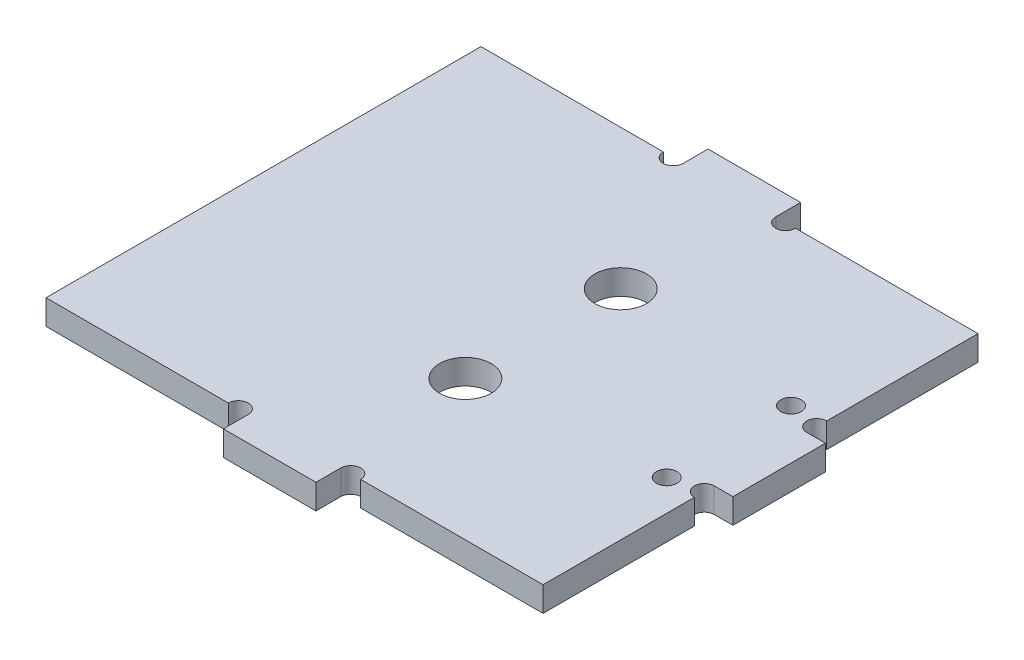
ISO-10303-21;
HEADER;
FILE_DESCRIPTION(('STEP AP214'),'2;1');
FILE_NAME('part.step','',(''),(''),'','','');
FILE_SCHEMA(('AUTOMOTIVE_DESIGN { 1 0 10303 214 1 1 1 1 }'));
ENDSEC;
DATA;
#1=APPLICATION_CONTEXT('core data for automotive mechanical design processes');
#2=APPLICATION_PROTOCOL_DEFINITION('international standard','automotive_design',2000,#1);
#3=PRODUCT_CONTEXT('',#1,'mechanical');
#4=PRODUCT('Part','Part','',(#3));
#5=PRODUCT_RELATED_PRODUCT_CATEGORY('part','',(#4));
#6=PRODUCT_DEFINITION_FORMATION('','',#4);
#7=PRODUCT_DEFINITION_CONTEXT('part definition',#1,'design');
#8=PRODUCT_DEFINITION('design','',#6,#7);
#9=PRODUCT_DEFINITION_SHAPE('','',#8);
#10=(LENGTH_UNIT() NAMED_UNIT(*) SI_UNIT(.MILLI.,.METRE.));
#11=(NAMED_UNIT(*) PLANE_ANGLE_UNIT() SI_UNIT($,.RADIAN.));
#12=(NAMED_UNIT(*) SI_UNIT($,.STERADIAN.) SOLID_ANGLE_UNIT());
#13=UNCERTAINTY_MEASURE_WITH_UNIT(LENGTH_MEASURE(1.E-05),#10,'distance_accuracy_value','');
#14=(GEOMETRIC_REPRESENTATION_CONTEXT(3) GLOBAL_UNCERTAINTY_ASSIGNED_CONTEXT((#13)) GLOBAL_UNIT_ASSIGNED_CONTEXT((#10,
#11,#12)) REPRESENTATION_CONTEXT('',''));
#15=CARTESIAN_POINT('',(0.,0.,0.));
#16=DIRECTION('',(0.,0.,1.));
#17=DIRECTION('',(1.,0.,0.));
#18=AXIS2_PLACEMENT_3D('',#15,#16,#17);
#19=CARTESIAN_POINT('',(30.95,-6.,0.));
#20=DIRECTION('',(0.,1.,0.));
#21=DIRECTION('',(0.,0.,1.));
#22=AXIS2_PLACEMENT_3D('',#19,#20,#21);
#23=CYLINDRICAL_SURFACE('',#22,1.6);
#24=CARTESIAN_POINT('',(30.95,0.,0.));
#25=DIRECTION('',(0.,1.,0.));
#26=DIRECTION('',(0.,0.,1.));
#27=AXIS2_PLACEMENT_3D('',#24,#25,#26);
#28=CIRCLE('',#27,1.6);
#29=CARTESIAN_POINT('',(32.55,0.,0.));
#30=VERTEX_POINT('',#29);
#31=CARTESIAN_POINT('',(29.35,0.,0.));
#32=VERTEX_POINT('',#31);
#33=EDGE_CURVE('E456',#30,#32,#28,.T.);
#34=ORIENTED_EDGE('',*,*,#33,.F.);
#35=DIRECTION('',(0.,-1.,0.));
#36=VECTOR('',#35,1.);
#37=CARTESIAN_POINT('',(32.55,4.,0.));
#38=LINE('',#37,#36);
#39=CARTESIAN_POINT('',(32.55,4.,0.));
#40=VERTEX_POINT('',#39);
#41=EDGE_CURVE('E224',#40,#30,#38,.T.);
#42=ORIENTED_EDGE('',*,*,#41,.F.);
#43=CARTESIAN_POINT('',(30.95,4.,0.));
#44=DIRECTION('',(0.,1.,0.));
#45=DIRECTION('',(0.,0.,1.));
#46=AXIS2_PLACEMENT_3D('',#43,#44,#45);
#47=CIRCLE('',#46,1.6);
#48=CARTESIAN_POINT('',(29.35,4.,0.));
#49=VERTEX_POINT('',#48);
#50=EDGE_CURVE('E117',#40,#49,#47,.T.);
#51=ORIENTED_EDGE('',*,*,#50,.T.);
#52=DIRECTION('',(0.,1.,0.));
#53=VECTOR('',#52,1.);
#54=CARTESIAN_POINT('',(29.35,-6.,0.));
#55=LINE('',#54,#53);
#56=EDGE_CURVE('E246',#32,#49,#55,.T.);
#57=ORIENTED_EDGE('',*,*,#56,.F.);
#58=EDGE_LOOP('',(#34,#42,#51,#57));
#59=FACE_BOUND('',#58,.T.);
#60=ADVANCED_FACE('F17',(#59),#23,.F.);
#61=CARTESIAN_POINT('',(49.05,-6.,0.));
#62=DIRECTION('',(0.,1.,0.));
#63=DIRECTION('',(0.,0.,1.));
#64=AXIS2_PLACEMENT_3D('',#61,#62,#63);
#65=CYLINDRICAL_SURFACE('',#64,1.6);
#66=CARTESIAN_POINT('',(49.05,0.,0.));
#67=DIRECTION('',(0.,1.,0.));
#68=DIRECTION('',(0.,0.,1.));
#69=AXIS2_PLACEMENT_3D('',#66,#67,#68);
#70=CIRCLE('',#69,1.6);
#71=CARTESIAN_POINT('',(50.65,0.,0.));
#72=VERTEX_POINT('',#71);
#73=CARTESIAN_POINT('',(47.45,0.,0.));
#74=VERTEX_POINT('',#73);
#75=EDGE_CURVE('E125',#72,#74,#70,.T.);
#76=ORIENTED_EDGE('',*,*,#75,.F.);
#77=DIRECTION('',(0.,-1.,0.));
#78=VECTOR('',#77,1.);
#79=CARTESIAN_POINT('',(50.65,-6.,0.));
#80=LINE('',#79,#78);
#81=CARTESIAN_POINT('',(50.65,4.,0.));
#82=VERTEX_POINT('',#81);
#83=EDGE_CURVE('E121',#82,#72,#80,.T.);
#84=ORIENTED_EDGE('',*,*,#83,.F.);
#85=CARTESIAN_POINT('',(49.05,4.,0.));
#86=DIRECTION('',(0.,1.,0.));
#87=DIRECTION('',(0.,0.,1.));
#88=AXIS2_PLACEMENT_3D('',#85,#86,#87);
#89=CIRCLE('',#88,1.6);
#90=CARTESIAN_POINT('',(47.45,4.,0.));
#91=VERTEX_POINT('',#90);
#92=EDGE_CURVE('E105',#82,#91,#89,.T.);
#93=ORIENTED_EDGE('',*,*,#92,.T.);
#94=DIRECTION('',(0.,-1.,0.));
#95=VECTOR('',#94,1.);
#96=CARTESIAN_POINT('',(47.45,4.,0.));
#97=LINE('',#96,#95);
#98=EDGE_CURVE('E141',#91,#74,#97,.T.);
#99=ORIENTED_EDGE('',*,*,#98,.T.);
#100=EDGE_LOOP('',(#76,#84,#93,#99));
#101=FACE_BOUND('',#100,.T.);
#102=ADVANCED_FACE('F122',(#101),#65,.F.);
#103=CARTESIAN_POINT('',(80.,-6.,-25.95));
#104=DIRECTION('',(0.,1.,0.));
#105=DIRECTION('',(0.,0.,1.));
#106=AXIS2_PLACEMENT_3D('',#103,#104,#105);
#107=CYLINDRICAL_SURFACE('',#106,1.6);
#108=CARTESIAN_POINT('',(80.,0.,-25.95));
#109=DIRECTION('',(0.,1.,0.));
#110=DIRECTION('',(0.,0.,1.));
#111=AXIS2_PLACEMENT_3D('',#108,#109,#110);
#112=CIRCLE('',#111,1.6);
#113=CARTESIAN_POINT('',(80.,0.,-27.55));
#114=VERTEX_POINT('',#113);
#115=CARTESIAN_POINT('',(80.,0.,-24.35));
#116=VERTEX_POINT('',#115);
#117=EDGE_CURVE('E518',#114,#116,#112,.T.);
#118=ORIENTED_EDGE('',*,*,#117,.F.);
#119=DIRECTION('',(0.,-1.,0.));
#120=VECTOR('',#119,1.);
#121=CARTESIAN_POINT('',(80.,4.,-27.55));
#122=LINE('',#121,#120);
#123=CARTESIAN_POINT('',(80.,4.,-27.55));
#124=VERTEX_POINT('',#123);
#125=EDGE_CURVE('E374',#124,#114,#122,.T.);
#126=ORIENTED_EDGE('',*,*,#125,.F.);
#127=CARTESIAN_POINT('',(80.,4.,-25.95));
#128=DIRECTION('',(0.,1.,0.));
#129=DIRECTION('',(0.,0.,1.));
#130=AXIS2_PLACEMENT_3D('',#127,#128,#129);
#131=CIRCLE('',#130,1.6);
#132=CARTESIAN_POINT('',(80.,4.,-24.35));
#133=VERTEX_POINT('',#132);
#134=EDGE_CURVE('E26',#124,#133,#131,.T.);
#135=ORIENTED_EDGE('',*,*,#134,.T.);
#136=DIRECTION('',(0.,1.,0.));
#137=VECTOR('',#136,1.);
#138=CARTESIAN_POINT('',(80.,-6.,-24.35));
#139=LINE('',#138,#137);
#140=EDGE_CURVE('E169',#116,#133,#139,.T.);
#141=ORIENTED_EDGE('',*,*,#140,.F.);
#142=EDGE_LOOP('',(#118,#126,#135,#141));
#143=FACE_BOUND('',#142,.T.);
#144=ADVANCED_FACE('F949',(#143),#107,.F.);
#145=CARTESIAN_POINT('',(80.,-6.,-44.05));
#146=DIRECTION('',(0.,1.,0.));
#147=DIRECTION('',(0.,0.,1.));
#148=AXIS2_PLACEMENT_3D('',#145,#146,#147);
#149=CYLINDRICAL_SURFACE('',#148,1.6);
#150=CARTESIAN_POINT('',(80.,4.,-44.05));
#151=DIRECTION('',(0.,1.,0.));
#152=DIRECTION('',(0.,0.,1.));
#153=AXIS2_PLACEMENT_3D('',#150,#151,#152);
#154=CIRCLE('',#153,1.6);
#155=CARTESIAN_POINT('',(80.,4.,-45.65));
#156=VERTEX_POINT('',#155);
#157=CARTESIAN_POINT('',(80.,4.,-42.45));
#158=VERTEX_POINT('',#157);
#159=EDGE_CURVE('E11',#156,#158,#154,.T.);
#160=ORIENTED_EDGE('',*,*,#159,.T.);
#161=DIRECTION('',(0.,-1.,0.));
#162=VECTOR('',#161,1.);
#163=CARTESIAN_POINT('',(80.,4.,-42.45));
#164=LINE('',#163,#162);
#165=CARTESIAN_POINT('',(80.,0.,-42.45));
#166=VERTEX_POINT('',#165);
#167=EDGE_CURVE('E366',#158,#166,#164,.T.);
#168=ORIENTED_EDGE('',*,*,#167,.T.);
#169=CARTESIAN_POINT('',(80.,0.,-44.05));
#170=DIRECTION('',(0.,1.,0.));
#171=DIRECTION('',(0.,0.,1.));
#172=AXIS2_PLACEMENT_3D('',#169,#170,#171);
#173=CIRCLE('',#172,1.6);
#174=CARTESIAN_POINT('',(80.,0.,-45.65));
#175=VERTEX_POINT('',#174);
#176=EDGE_CURVE('E551',#175,#166,#173,.T.);
#177=ORIENTED_EDGE('',*,*,#176,.F.);
#178=DIRECTION('',(0.,-1.,0.));
#179=VECTOR('',#178,1.);
#180=CARTESIAN_POINT('',(80.,-6.,-45.65));
#181=LINE('',#180,#179);
#182=EDGE_CURVE('E340',#156,#175,#181,.T.);
#183=ORIENTED_EDGE('',*,*,#182,.F.);
#184=EDGE_LOOP('',(#160,#168,#177,#183));
#185=FACE_BOUND('',#184,.T.);
#186=ADVANCED_FACE('F932',(#185),#149,.F.);
#187=CARTESIAN_POINT('',(0.,4.,0.));
#188=DIRECTION('',(0.,1.,0.));
#189=DIRECTION('',(1.,0.,0.));
#190=AXIS2_PLACEMENT_3D('',#187,#188,#189);
#191=PLANE('',#190);
#192=CARTESIAN_POINT('',(45.,4.,-22.5));
#193=DIRECTION('',(0.,1.,0.));
#194=DIRECTION('',(0.,0.,1.));
#195=AXIS2_PLACEMENT_3D('',#192,#193,#194);
#196=CIRCLE('',#195,4.15);
#197=CARTESIAN_POINT('',(45.,4.,-18.35));
#198=VERTEX_POINT('',#197);
#199=EDGE_CURVE('E635',#198,#198,#196,.T.);
#200=ORIENTED_EDGE('',*,*,#199,.F.);
#201=EDGE_LOOP('',(#200));
#202=FACE_BOUND('',#201,.T.);
#203=CARTESIAN_POINT('',(45.,4.,-47.5));
#204=DIRECTION('',(0.,1.,0.));
#205=DIRECTION('',(0.,0.,1.));
#206=AXIS2_PLACEMENT_3D('',#203,#204,#205);
#207=CIRCLE('',#206,4.15);
#208=CARTESIAN_POINT('',(45.,4.,-43.35));
#209=VERTEX_POINT('',#208);
#210=EDGE_CURVE('E653',#209,#209,#207,.T.);
#211=ORIENTED_EDGE('',*,*,#210,.F.);
#212=EDGE_LOOP('',(#211));
#213=FACE_BOUND('',#212,.T.);
#214=CARTESIAN_POINT('',(75.,4.,-24.9000000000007));
#215=DIRECTION('',(0.,1.,0.));
#216=DIRECTION('',(0.,0.,1.));
#217=AXIS2_PLACEMENT_3D('',#214,#215,#216);
#218=CIRCLE('',#217,1.65);
#219=CARTESIAN_POINT('',(75.,4.,-23.2500000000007));
#220=VERTEX_POINT('',#219);
#221=EDGE_CURVE('E671',#220,#220,#218,.T.);
#222=ORIENTED_EDGE('',*,*,#221,.F.);
#223=EDGE_LOOP('',(#222));
#224=FACE_BOUND('',#223,.T.);
#225=CARTESIAN_POINT('',(75.,4.,-44.9000000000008));
#226=DIRECTION('',(0.,1.,0.));
#227=DIRECTION('',(0.,0.,1.));
#228=AXIS2_PLACEMENT_3D('',#225,#226,#227);
#229=CIRCLE('',#228,1.65);
#230=CARTESIAN_POINT('',(75.,4.,-43.2500000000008));
#231=VERTEX_POINT('',#230);
#232=EDGE_CURVE('E691',#231,#231,#229,.T.);
#233=ORIENTED_EDGE('',*,*,#232,.F.);
#234=EDGE_LOOP('',(#233));
#235=FACE_BOUND('',#234,.T.);
#236=CARTESIAN_POINT('',(49.05,4.,-70.));
#237=DIRECTION('',(0.,1.,0.));
#238=DIRECTION('',(0.,0.,1.));
#239=AXIS2_PLACEMENT_3D('',#236,#237,#238);
#240=CIRCLE('',#239,1.6);
#241=CARTESIAN_POINT('',(47.45,4.,-70.));
#242=VERTEX_POINT('',#241);
#243=CARTESIAN_POINT('',(50.65,4.,-70.));
#244=VERTEX_POINT('',#243);
#245=EDGE_CURVE('E617',#242,#244,#240,.T.);
#246=ORIENTED_EDGE('',*,*,#245,.F.);
#247=DIRECTION('',(0.,0.,-1.));
#248=VECTOR('',#247,1.);
#249=CARTESIAN_POINT('',(47.45,4.,0.));
#250=LINE('',#249,#248);
#251=CARTESIAN_POINT('',(47.45,4.,-74.));
#252=VERTEX_POINT('',#251);
#253=EDGE_CURVE('E313',#242,#252,#250,.T.);
#254=ORIENTED_EDGE('',*,*,#253,.T.);
#255=DIRECTION('',(1.,0.,0.));
#256=VECTOR('',#255,1.);
#257=CARTESIAN_POINT('',(0.,4.,-74.));
#258=LINE('',#257,#256);
#259=CARTESIAN_POINT('',(32.55,4.,-74.));
#260=VERTEX_POINT('',#259);
#261=EDGE_CURVE('E286',#260,#252,#258,.T.);
#262=ORIENTED_EDGE('',*,*,#261,.F.);
#263=DIRECTION('',(0.,0.,-1.));
#264=VECTOR('',#263,1.);
#265=CARTESIAN_POINT('',(32.55,4.,0.));
#266=LINE('',#265,#264);
#267=CARTESIAN_POINT('',(32.55,4.,-70.));
#268=VERTEX_POINT('',#267);
#269=EDGE_CURVE('E278',#268,#260,#266,.T.);
#270=ORIENTED_EDGE('',*,*,#269,.F.);
#271=CARTESIAN_POINT('',(30.95,4.,-70.));
#272=DIRECTION('',(0.,1.,0.));
#273=DIRECTION('',(0.,0.,1.));
#274=AXIS2_PLACEMENT_3D('',#271,#272,#273);
#275=CIRCLE('',#274,1.6);
#276=CARTESIAN_POINT('',(29.35,4.,-70.));
#277=VERTEX_POINT('',#276);
#278=EDGE_CURVE('E588',#277,#268,#275,.T.);
#279=ORIENTED_EDGE('',*,*,#278,.F.);
#280=DIRECTION('',(1.,0.,0.));
#281=VECTOR('',#280,1.);
#282=CARTESIAN_POINT('',(0.,4.,-70.));
#283=LINE('',#282,#281);
#284=CARTESIAN_POINT('',(0.,4.,-70.));
#285=VERTEX_POINT('',#284);
#286=EDGE_CURVE('E267',#285,#277,#283,.T.);
#287=ORIENTED_EDGE('',*,*,#286,.F.);
#288=DIRECTION('',(0.,0.,-1.));
#289=VECTOR('',#288,1.);
#290=CARTESIAN_POINT('',(0.,4.,0.));
#291=LINE('',#290,#289);
#292=CARTESIAN_POINT('',(0.,4.,0.));
#293=VERTEX_POINT('',#292);
#294=EDGE_CURVE('E252',#293,#285,#291,.T.);
#295=ORIENTED_EDGE('',*,*,#294,.F.);
#296=DIRECTION('',(1.,0.,0.));
#297=VECTOR('',#296,1.);
#298=CARTESIAN_POINT('',(0.,4.,0.));
#299=LINE('',#298,#297);
#300=EDGE_CURVE('E236',#293,#49,#299,.T.);
#301=ORIENTED_EDGE('',*,*,#300,.T.);
#302=ORIENTED_EDGE('',*,*,#50,.F.);
#303=DIRECTION('',(0.,0.,1.));
#304=VECTOR('',#303,1.);
#305=CARTESIAN_POINT('',(32.55,4.,0.));
#306=LINE('',#305,#304);
#307=CARTESIAN_POINT('',(32.55,4.,4.));
#308=VERTEX_POINT('',#307);
#309=EDGE_CURVE('E235',#40,#308,#306,.T.);
#310=ORIENTED_EDGE('',*,*,#309,.T.);
#311=DIRECTION('',(1.,0.,0.));
#312=VECTOR('',#311,1.);
#313=CARTESIAN_POINT('',(0.,4.,4.));
#314=LINE('',#313,#312);
#315=CARTESIAN_POINT('',(47.45,4.,4.));
#316=VERTEX_POINT('',#315);
#317=EDGE_CURVE('E208',#308,#316,#314,.T.);
#318=ORIENTED_EDGE('',*,*,#317,.T.);
#319=DIRECTION('',(0.,0.,1.));
#320=VECTOR('',#319,1.);
#321=CARTESIAN_POINT('',(47.45,4.,0.));
#322=LINE('',#321,#320);
#323=EDGE_CURVE('E112',#91,#316,#322,.T.);
#324=ORIENTED_EDGE('',*,*,#323,.F.);
#325=ORIENTED_EDGE('',*,*,#92,.F.);
#326=DIRECTION('',(1.,0.,0.));
#327=VECTOR('',#326,1.);
#328=CARTESIAN_POINT('',(0.,4.,0.));
#329=LINE('',#328,#327);
#330=CARTESIAN_POINT('',(80.,4.,0.));
#331=VERTEX_POINT('',#330);
#332=EDGE_CURVE('E110',#82,#331,#329,.T.);
#333=ORIENTED_EDGE('',*,*,#332,.T.);
#334=DIRECTION('',(0.,0.,-1.));
#335=VECTOR('',#334,1.);
#336=CARTESIAN_POINT('',(80.,4.,0.));
#337=LINE('',#336,#335);
#338=EDGE_CURVE('E146',#331,#133,#337,.T.);
#339=ORIENTED_EDGE('',*,*,#338,.T.);
#340=ORIENTED_EDGE('',*,*,#134,.F.);
#341=DIRECTION('',(1.,0.,0.));
#342=VECTOR('',#341,1.);
#343=CARTESIAN_POINT('',(0.,4.,-27.55));
#344=LINE('',#343,#342);
#345=CARTESIAN_POINT('',(83.,4.,-27.55));
#346=VERTEX_POINT('',#345);
#347=EDGE_CURVE('E382',#124,#346,#344,.T.);
#348=ORIENTED_EDGE('',*,*,#347,.T.);
#349=DIRECTION('',(0.,0.,1.));
#350=VECTOR('',#349,1.);
#351=CARTESIAN_POINT('',(83.,4.,0.));
#352=LINE('',#351,#350);
#353=CARTESIAN_POINT('',(83.,4.,-42.45));
#354=VERTEX_POINT('',#353);
#355=EDGE_CURVE('E399',#354,#346,#352,.T.);
#356=ORIENTED_EDGE('',*,*,#355,.F.);
#357=DIRECTION('',(1.,0.,0.));
#358=VECTOR('',#357,1.);
#359=CARTESIAN_POINT('',(80.,4.,-42.45));
#360=LINE('',#359,#358);
#361=EDGE_CURVE('E360',#158,#354,#360,.T.);
#362=ORIENTED_EDGE('',*,*,#361,.F.);
#363=ORIENTED_EDGE('',*,*,#159,.F.);
#364=DIRECTION('',(0.,0.,-1.));
#365=VECTOR('',#364,1.);
#366=CARTESIAN_POINT('',(80.,4.,0.));
#367=LINE('',#366,#365);
#368=CARTESIAN_POINT('',(80.,4.,-70.));
#369=VERTEX_POINT('',#368);
#370=EDGE_CURVE('E351',#156,#369,#367,.T.);
#371=ORIENTED_EDGE('',*,*,#370,.T.);
#372=DIRECTION('',(1.,0.,0.));
#373=VECTOR('',#372,1.);
#374=CARTESIAN_POINT('',(0.,4.,-70.));
#375=LINE('',#374,#373);
#376=EDGE_CURVE('E324',#244,#369,#375,.T.);
#377=ORIENTED_EDGE('',*,*,#376,.F.);
#378=EDGE_LOOP('',(#246,#254,#262,#270,#279,#287,#295,#301,#302,#310,#318,#324,#325,#333,#339,
#340,#348,#356,#362,#363,#371,#377));
#379=FACE_BOUND('',#378,.T.);
#380=ADVANCED_FACE('F108',(#202,#213,#224,#235,#379),#191,.T.);
#381=CARTESIAN_POINT('',(80.,4.,0.));
#382=DIRECTION('',(-1.,0.,0.));
#383=DIRECTION('',(0.,0.,1.));
#384=AXIS2_PLACEMENT_3D('',#381,#382,#383);
#385=PLANE('',#384);
#386=DIRECTION('',(0.,0.,-1.));
#387=VECTOR('',#386,1.);
#388=CARTESIAN_POINT('',(80.,0.,0.));
#389=LINE('',#388,#387);
#390=CARTESIAN_POINT('',(80.,0.,0.));
#391=VERTEX_POINT('',#390);
#392=EDGE_CURVE('E509',#391,#116,#389,.T.);
#393=ORIENTED_EDGE('',*,*,#392,.T.);
#394=ORIENTED_EDGE('',*,*,#140,.T.);
#395=ORIENTED_EDGE('',*,*,#338,.F.);
#396=DIRECTION('',(0.,-1.,0.));
#397=VECTOR('',#396,1.);
#398=CARTESIAN_POINT('',(80.,4.,0.));
#399=LINE('',#398,#397);
#400=EDGE_CURVE('E130',#331,#391,#399,.T.);
#401=ORIENTED_EDGE('',*,*,#400,.T.);
#402=EDGE_LOOP('',(#393,#394,#395,#401));
#403=FACE_BOUND('',#402,.T.);
#404=ADVANCED_FACE('F951',(#403),#385,.F.);
#405=CARTESIAN_POINT('',(0.,4.,0.));
#406=DIRECTION('',(0.,0.,-1.));
#407=DIRECTION('',(0.,-1.,0.));
#408=AXIS2_PLACEMENT_3D('',#405,#406,#407);
#409=PLANE('',#408);
#410=ORIENTED_EDGE('',*,*,#332,.F.);
#411=ORIENTED_EDGE('',*,*,#83,.T.);
#412=DIRECTION('',(1.,0.,0.));
#413=VECTOR('',#412,1.);
#414=CARTESIAN_POINT('',(0.,0.,0.));
#415=LINE('',#414,#413);
#416=EDGE_CURVE('E501',#72,#391,#415,.T.);
#417=ORIENTED_EDGE('',*,*,#416,.T.);
#418=ORIENTED_EDGE('',*,*,#400,.F.);
#419=EDGE_LOOP('',(#410,#411,#417,#418));
#420=FACE_BOUND('',#419,.T.);
#421=ADVANCED_FACE('F133',(#420),#409,.F.);
#422=CARTESIAN_POINT('',(47.45,4.,0.));
#423=DIRECTION('',(1.,0.,0.));
#424=DIRECTION('',(0.,1.,0.));
#425=AXIS2_PLACEMENT_3D('',#422,#423,#424);
#426=PLANE('',#425);
#427=DIRECTION('',(0.,0.,1.));
#428=VECTOR('',#427,1.);
#429=CARTESIAN_POINT('',(47.45,0.,0.));
#430=LINE('',#429,#428);
#431=CARTESIAN_POINT('',(47.45,0.,4.));
#432=VERTEX_POINT('',#431);
#433=EDGE_CURVE('E484',#74,#432,#430,.T.);
#434=ORIENTED_EDGE('',*,*,#433,.F.);
#435=ORIENTED_EDGE('',*,*,#98,.F.);
#436=ORIENTED_EDGE('',*,*,#323,.T.);
#437=DIRECTION('',(0.,-1.,0.));
#438=VECTOR('',#437,1.);
#439=CARTESIAN_POINT('',(47.45,4.,4.));
#440=LINE('',#439,#438);
#441=EDGE_CURVE('E215',#316,#432,#440,.T.);
#442=ORIENTED_EDGE('',*,*,#441,.T.);
#443=EDGE_LOOP('',(#434,#435,#436,#442));
#444=FACE_BOUND('',#443,.T.);
#445=ADVANCED_FACE('F1271',(#444),#426,.T.);
#446=CARTESIAN_POINT('',(0.,4.,4.));
#447=DIRECTION('',(0.,0.,-1.));
#448=DIRECTION('',(0.,-1.,0.));
#449=AXIS2_PLACEMENT_3D('',#446,#447,#448);
#450=PLANE('',#449);
#451=DIRECTION('',(1.,0.,0.));
#452=VECTOR('',#451,1.);
#453=CARTESIAN_POINT('',(0.,0.,4.));
#454=LINE('',#453,#452);
#455=CARTESIAN_POINT('',(32.55,0.,4.));
#456=VERTEX_POINT('',#455);
#457=EDGE_CURVE('E474',#456,#432,#454,.T.);
#458=ORIENTED_EDGE('',*,*,#457,.T.);
#459=ORIENTED_EDGE('',*,*,#441,.F.);
#460=ORIENTED_EDGE('',*,*,#317,.F.);
#461=DIRECTION('',(0.,-1.,0.));
#462=VECTOR('',#461,1.);
#463=CARTESIAN_POINT('',(32.55,4.,4.));
#464=LINE('',#463,#462);
#465=EDGE_CURVE('E230',#308,#456,#464,.T.);
#466=ORIENTED_EDGE('',*,*,#465,.T.);
#467=EDGE_LOOP('',(#458,#459,#460,#466));
#468=FACE_BOUND('',#467,.T.);
#469=ADVANCED_FACE('F1263',(#468),#450,.F.);
#470=CARTESIAN_POINT('',(32.55,4.,0.));
#471=DIRECTION('',(1.,0.,0.));
#472=DIRECTION('',(0.,1.,0.));
#473=AXIS2_PLACEMENT_3D('',#470,#471,#472);
#474=PLANE('',#473);
#475=DIRECTION('',(0.,0.,1.));
#476=VECTOR('',#475,1.);
#477=CARTESIAN_POINT('',(32.55,0.,0.));
#478=LINE('',#477,#476);
#479=EDGE_CURVE('E464',#30,#456,#478,.T.);
#480=ORIENTED_EDGE('',*,*,#479,.T.);
#481=ORIENTED_EDGE('',*,*,#465,.F.);
#482=ORIENTED_EDGE('',*,*,#309,.F.);
#483=ORIENTED_EDGE('',*,*,#41,.T.);
#484=EDGE_LOOP('',(#480,#481,#482,#483));
#485=FACE_BOUND('',#484,.T.);
#486=ADVANCED_FACE('F1255',(#485),#474,.F.);
#487=CARTESIAN_POINT('',(0.,4.,0.));
#488=DIRECTION('',(0.,0.,-1.));
#489=DIRECTION('',(0.,-1.,0.));
#490=AXIS2_PLACEMENT_3D('',#487,#488,#489);
#491=PLANE('',#490);
#492=DIRECTION('',(1.,0.,0.));
#493=VECTOR('',#492,1.);
#494=CARTESIAN_POINT('',(0.,0.,0.));
#495=LINE('',#494,#493);
#496=CARTESIAN_POINT('',(0.,0.,0.));
#497=VERTEX_POINT('',#496);
#498=EDGE_CURVE('E448',#497,#32,#495,.T.);
#499=ORIENTED_EDGE('',*,*,#498,.T.);
#500=ORIENTED_EDGE('',*,*,#56,.T.);
#501=ORIENTED_EDGE('',*,*,#300,.F.);
#502=DIRECTION('',(0.,-1.,0.));
#503=VECTOR('',#502,1.);
#504=CARTESIAN_POINT('',(0.,4.,0.));
#505=LINE('',#504,#503);
#506=EDGE_CURVE('E256',#293,#497,#505,.T.);
#507=ORIENTED_EDGE('',*,*,#506,.T.);
#508=EDGE_LOOP('',(#499,#500,#501,#507));
#509=FACE_BOUND('',#508,.T.);
#510=ADVANCED_FACE('F795',(#509),#491,.F.);
#511=CARTESIAN_POINT('',(0.,4.,0.));
#512=DIRECTION('',(-1.,0.,0.));
#513=DIRECTION('',(0.,0.,1.));
#514=AXIS2_PLACEMENT_3D('',#511,#512,#513);
#515=PLANE('',#514);
#516=DIRECTION('',(0.,0.,-1.));
#517=VECTOR('',#516,1.);
#518=CARTESIAN_POINT('',(0.,0.,0.));
#519=LINE('',#518,#517);
#520=CARTESIAN_POINT('',(0.,0.,-70.));
#521=VERTEX_POINT('',#520);
#522=EDGE_CURVE('E440',#497,#521,#519,.T.);
#523=ORIENTED_EDGE('',*,*,#522,.F.);
#524=ORIENTED_EDGE('',*,*,#506,.F.);
#525=ORIENTED_EDGE('',*,*,#294,.T.);
#526=DIRECTION('',(0.,-1.,0.));
#527=VECTOR('',#526,1.);
#528=CARTESIAN_POINT('',(0.,4.,-70.));
#529=LINE('',#528,#527);
#530=EDGE_CURVE('E262',#285,#521,#529,.T.);
#531=ORIENTED_EDGE('',*,*,#530,.T.);
#532=EDGE_LOOP('',(#523,#524,#525,#531));
#533=FACE_BOUND('',#532,.T.);
#534=ADVANCED_FACE('F803',(#533),#515,.T.);
#535=CARTESIAN_POINT('',(0.,4.,-70.));
#536=DIRECTION('',(0.,0.,-1.));
#537=DIRECTION('',(0.,-1.,0.));
#538=AXIS2_PLACEMENT_3D('',#535,#536,#537);
#539=PLANE('',#538);
#540=DIRECTION('',(0.,1.,0.));
#541=VECTOR('',#540,1.);
#542=CARTESIAN_POINT('',(29.35,-6.,-70.));
#543=LINE('',#542,#541);
#544=CARTESIAN_POINT('',(29.35,0.,-70.));
#545=VERTEX_POINT('',#544);
#546=EDGE_CURVE('E268',#545,#277,#543,.T.);
#547=ORIENTED_EDGE('',*,*,#546,.F.);
#548=DIRECTION('',(1.,0.,0.));
#549=VECTOR('',#548,1.);
#550=CARTESIAN_POINT('',(0.,0.,-70.));
#551=LINE('',#550,#549);
#552=EDGE_CURVE('E432',#521,#545,#551,.T.);
#553=ORIENTED_EDGE('',*,*,#552,.F.);
#554=ORIENTED_EDGE('',*,*,#530,.F.);
#555=ORIENTED_EDGE('',*,*,#286,.T.);
#556=EDGE_LOOP('',(#547,#553,#554,#555));
#557=FACE_BOUND('',#556,.T.);
#558=ADVANCED_FACE('F1232',(#557),#539,.T.);
#559=CARTESIAN_POINT('',(32.55,4.,0.));
#560=DIRECTION('',(-1.,0.,0.));
#561=DIRECTION('',(0.,0.,1.));
#562=AXIS2_PLACEMENT_3D('',#559,#560,#561);
#563=PLANE('',#562);
#564=DIRECTION('',(0.,0.,-1.));
#565=VECTOR('',#564,1.);
#566=CARTESIAN_POINT('',(32.55,0.,0.));
#567=LINE('',#566,#565);
#568=CARTESIAN_POINT('',(32.55,0.,-70.));
#569=VERTEX_POINT('',#568);
#570=CARTESIAN_POINT('',(32.55,0.,-74.));
#571=VERTEX_POINT('',#570);
#572=EDGE_CURVE('E424',#569,#571,#567,.T.);
#573=ORIENTED_EDGE('',*,*,#572,.F.);
#574=DIRECTION('',(0.,-1.,0.));
#575=VECTOR('',#574,1.);
#576=CARTESIAN_POINT('',(32.55,4.,-70.));
#577=LINE('',#576,#575);
#578=EDGE_CURVE('E581',#268,#569,#577,.T.);
#579=ORIENTED_EDGE('',*,*,#578,.F.);
#580=ORIENTED_EDGE('',*,*,#269,.T.);
#581=DIRECTION('',(0.,-1.,0.));
#582=VECTOR('',#581,1.);
#583=CARTESIAN_POINT('',(32.55,4.,-74.));
#584=LINE('',#583,#582);
#585=EDGE_CURVE('E295',#260,#571,#584,.T.);
#586=ORIENTED_EDGE('',*,*,#585,.T.);
#587=EDGE_LOOP('',(#573,#579,#580,#586));
#588=FACE_BOUND('',#587,.T.);
#589=ADVANCED_FACE('F846',(#588),#563,.T.);
#590=CARTESIAN_POINT('',(0.,4.,-74.));
#591=DIRECTION('',(0.,0.,-1.));
#592=DIRECTION('',(0.,-1.,0.));
#593=AXIS2_PLACEMENT_3D('',#590,#591,#592);
#594=PLANE('',#593);
#595=DIRECTION('',(1.,0.,0.));
#596=VECTOR('',#595,1.);
#597=CARTESIAN_POINT('',(0.,0.,-74.));
#598=LINE('',#597,#596);
#599=CARTESIAN_POINT('',(47.45,0.,-74.));
#600=VERTEX_POINT('',#599);
#601=EDGE_CURVE('E416',#571,#600,#598,.T.);
#602=ORIENTED_EDGE('',*,*,#601,.F.);
#603=ORIENTED_EDGE('',*,*,#585,.F.);
#604=ORIENTED_EDGE('',*,*,#261,.T.);
#605=DIRECTION('',(0.,-1.,0.));
#606=VECTOR('',#605,1.);
#607=CARTESIAN_POINT('',(47.45,4.,-74.));
#608=LINE('',#607,#606);
#609=EDGE_CURVE('E319',#252,#600,#608,.T.);
#610=ORIENTED_EDGE('',*,*,#609,.T.);
#611=EDGE_LOOP('',(#602,#603,#604,#610));
#612=FACE_BOUND('',#611,.T.);
#613=ADVANCED_FACE('F852',(#612),#594,.T.);
#614=CARTESIAN_POINT('',(47.45,4.,0.));
#615=DIRECTION('',(-1.,0.,0.));
#616=DIRECTION('',(0.,0.,1.));
#617=AXIS2_PLACEMENT_3D('',#614,#615,#616);
#618=PLANE('',#617);
#619=DIRECTION('',(0.,0.,-1.));
#620=VECTOR('',#619,1.);
#621=CARTESIAN_POINT('',(47.45,0.,0.));
#622=LINE('',#621,#620);
#623=CARTESIAN_POINT('',(47.45,0.,-70.));
#624=VERTEX_POINT('',#623);
#625=EDGE_CURVE('E574',#624,#600,#622,.T.);
#626=ORIENTED_EDGE('',*,*,#625,.T.);
#627=ORIENTED_EDGE('',*,*,#609,.F.);
#628=ORIENTED_EDGE('',*,*,#253,.F.);
#629=DIRECTION('',(0.,-1.,0.));
#630=VECTOR('',#629,1.);
#631=CARTESIAN_POINT('',(47.45,4.,-70.));
#632=LINE('',#631,#630);
#633=EDGE_CURVE('E304',#242,#624,#632,.T.);
#634=ORIENTED_EDGE('',*,*,#633,.T.);
#635=EDGE_LOOP('',(#626,#627,#628,#634));
#636=FACE_BOUND('',#635,.T.);
#637=ADVANCED_FACE('F917',(#636),#618,.F.);
#638=CARTESIAN_POINT('',(0.,4.,-70.));
#639=DIRECTION('',(0.,0.,-1.));
#640=DIRECTION('',(0.,-1.,0.));
#641=AXIS2_PLACEMENT_3D('',#638,#639,#640);
#642=PLANE('',#641);
#643=DIRECTION('',(0.,-1.,0.));
#644=VECTOR('',#643,1.);
#645=CARTESIAN_POINT('',(50.65,-6.,-70.));
#646=LINE('',#645,#644);
#647=CARTESIAN_POINT('',(50.65,0.,-70.));
#648=VERTEX_POINT('',#647);
#649=EDGE_CURVE('E607',#244,#648,#646,.T.);
#650=ORIENTED_EDGE('',*,*,#649,.F.);
#651=ORIENTED_EDGE('',*,*,#376,.T.);
#652=DIRECTION('',(0.,-1.,0.));
#653=VECTOR('',#652,1.);
#654=CARTESIAN_POINT('',(80.,4.,-70.));
#655=LINE('',#654,#653);
#656=CARTESIAN_POINT('',(80.,0.,-70.));
#657=VERTEX_POINT('',#656);
#658=EDGE_CURVE('E336',#369,#657,#655,.T.);
#659=ORIENTED_EDGE('',*,*,#658,.T.);
#660=DIRECTION('',(1.,0.,0.));
#661=VECTOR('',#660,1.);
#662=CARTESIAN_POINT('',(0.,0.,-70.));
#663=LINE('',#662,#661);
#664=EDGE_CURVE('E567',#648,#657,#663,.T.);
#665=ORIENTED_EDGE('',*,*,#664,.F.);
#666=EDGE_LOOP('',(#650,#651,#659,#665));
#667=FACE_BOUND('',#666,.T.);
#668=ADVANCED_FACE('F923',(#667),#642,.T.);
#669=CARTESIAN_POINT('',(80.,4.,0.));
#670=DIRECTION('',(-1.,0.,0.));
#671=DIRECTION('',(0.,0.,1.));
#672=AXIS2_PLACEMENT_3D('',#669,#670,#671);
#673=PLANE('',#672);
#674=ORIENTED_EDGE('',*,*,#370,.F.);
#675=ORIENTED_EDGE('',*,*,#182,.T.);
#676=DIRECTION('',(0.,0.,-1.));
#677=VECTOR('',#676,1.);
#678=CARTESIAN_POINT('',(80.,0.,0.));
#679=LINE('',#678,#677);
#680=EDGE_CURVE('E560',#175,#657,#679,.T.);
#681=ORIENTED_EDGE('',*,*,#680,.T.);
#682=ORIENTED_EDGE('',*,*,#658,.F.);
#683=EDGE_LOOP('',(#674,#675,#681,#682));
#684=FACE_BOUND('',#683,.T.);
#685=ADVANCED_FACE('F927',(#684),#673,.F.);
#686=CARTESIAN_POINT('',(80.,4.,-42.45));
#687=DIRECTION('',(0.,0.,-1.));
#688=DIRECTION('',(0.,-1.,0.));
#689=AXIS2_PLACEMENT_3D('',#686,#687,#688);
#690=PLANE('',#689);
#691=DIRECTION('',(1.,0.,0.));
#692=VECTOR('',#691,1.);
#693=CARTESIAN_POINT('',(80.,0.,-42.45));
#694=LINE('',#693,#692);
#695=CARTESIAN_POINT('',(83.,0.,-42.45));
#696=VERTEX_POINT('',#695);
#697=EDGE_CURVE('E543',#166,#696,#694,.T.);
#698=ORIENTED_EDGE('',*,*,#697,.F.);
#699=ORIENTED_EDGE('',*,*,#167,.F.);
#700=ORIENTED_EDGE('',*,*,#361,.T.);
#701=DIRECTION('',(0.,-1.,0.));
#702=VECTOR('',#701,1.);
#703=CARTESIAN_POINT('',(83.,4.,-42.45));
#704=LINE('',#703,#702);
#705=EDGE_CURVE('E407',#354,#696,#704,.T.);
#706=ORIENTED_EDGE('',*,*,#705,.T.);
#707=EDGE_LOOP('',(#698,#699,#700,#706));
#708=FACE_BOUND('',#707,.T.);
#709=ADVANCED_FACE('F936',(#708),#690,.T.);
#710=CARTESIAN_POINT('',(0.,4.,-27.55));
#711=DIRECTION('',(0.,0.,-1.));
#712=DIRECTION('',(0.,-1.,0.));
#713=AXIS2_PLACEMENT_3D('',#710,#711,#712);
#714=PLANE('',#713);
#715=DIRECTION('',(1.,0.,0.));
#716=VECTOR('',#715,1.);
#717=CARTESIAN_POINT('',(0.,0.,-27.55));
#718=LINE('',#717,#716);
#719=CARTESIAN_POINT('',(83.,0.,-27.55));
#720=VERTEX_POINT('',#719);
#721=EDGE_CURVE('E527',#114,#720,#718,.T.);
#722=ORIENTED_EDGE('',*,*,#721,.T.);
#723=DIRECTION('',(0.,-1.,0.));
#724=VECTOR('',#723,1.);
#725=CARTESIAN_POINT('',(83.,4.,-27.55));
#726=LINE('',#725,#724);
#727=EDGE_CURVE('E390',#346,#720,#726,.T.);
#728=ORIENTED_EDGE('',*,*,#727,.F.);
#729=ORIENTED_EDGE('',*,*,#347,.F.);
#730=ORIENTED_EDGE('',*,*,#125,.T.);
#731=EDGE_LOOP('',(#722,#728,#729,#730));
#732=FACE_BOUND('',#731,.T.);
#733=ADVANCED_FACE('F947',(#732),#714,.F.);
#734=CARTESIAN_POINT('',(83.,4.,0.));
#735=DIRECTION('',(1.,0.,0.));
#736=DIRECTION('',(0.,1.,0.));
#737=AXIS2_PLACEMENT_3D('',#734,#735,#736);
#738=PLANE('',#737);
#739=DIRECTION('',(0.,0.,1.));
#740=VECTOR('',#739,1.);
#741=CARTESIAN_POINT('',(83.,0.,0.));
#742=LINE('',#741,#740);
#743=EDGE_CURVE('E534',#696,#720,#742,.T.);
#744=ORIENTED_EDGE('',*,*,#743,.F.);
#745=ORIENTED_EDGE('',*,*,#705,.F.);
#746=ORIENTED_EDGE('',*,*,#355,.T.);
#747=ORIENTED_EDGE('',*,*,#727,.T.);
#748=EDGE_LOOP('',(#744,#745,#746,#747));
#749=FACE_BOUND('',#748,.T.);
#750=ADVANCED_FACE('F941',(#749),#738,.T.);
#751=CARTESIAN_POINT('',(0.,0.,0.));
#752=DIRECTION('',(0.,1.,0.));
#753=DIRECTION('',(1.,0.,0.));
#754=AXIS2_PLACEMENT_3D('',#751,#752,#753);
#755=PLANE('',#754);
#756=CARTESIAN_POINT('',(45.,0.,-22.5));
#757=DIRECTION('',(0.,1.,0.));
#758=DIRECTION('',(0.,0.,1.));
#759=AXIS2_PLACEMENT_3D('',#756,#757,#758);
#760=CIRCLE('',#759,4.15);
#761=CARTESIAN_POINT('',(45.,0.,-18.35));
#762=VERTEX_POINT('',#761);
#763=EDGE_CURVE('E644',#762,#762,#760,.T.);
#764=ORIENTED_EDGE('',*,*,#763,.T.);
#765=EDGE_LOOP('',(#764));
#766=FACE_BOUND('',#765,.T.);
#767=CARTESIAN_POINT('',(45.,0.,-47.5));
#768=DIRECTION('',(0.,1.,0.));
#769=DIRECTION('',(0.,0.,1.));
#770=AXIS2_PLACEMENT_3D('',#767,#768,#769);
#771=CIRCLE('',#770,4.15);
#772=CARTESIAN_POINT('',(45.,0.,-43.35));
#773=VERTEX_POINT('',#772);
#774=EDGE_CURVE('E662',#773,#773,#771,.T.);
#775=ORIENTED_EDGE('',*,*,#774,.T.);
#776=EDGE_LOOP('',(#775));
#777=FACE_BOUND('',#776,.T.);
#778=CARTESIAN_POINT('',(75.,0.,-24.9000000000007));
#779=DIRECTION('',(0.,1.,0.));
#780=DIRECTION('',(0.,0.,1.));
#781=AXIS2_PLACEMENT_3D('',#778,#779,#780);
#782=CIRCLE('',#781,1.65);
#783=CARTESIAN_POINT('',(75.,0.,-23.2500000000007));
#784=VERTEX_POINT('',#783);
#785=EDGE_CURVE('E681',#784,#784,#782,.T.);
#786=ORIENTED_EDGE('',*,*,#785,.T.);
#787=EDGE_LOOP('',(#786));
#788=FACE_BOUND('',#787,.T.);
#789=CARTESIAN_POINT('',(75.,0.,-44.9000000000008));
#790=DIRECTION('',(0.,1.,0.));
#791=DIRECTION('',(0.,0.,1.));
#792=AXIS2_PLACEMENT_3D('',#789,#790,#791);
#793=CIRCLE('',#792,1.65);
#794=CARTESIAN_POINT('',(75.,0.,-43.2500000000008));
#795=VERTEX_POINT('',#794);
#796=EDGE_CURVE('E700',#795,#795,#793,.T.);
#797=ORIENTED_EDGE('',*,*,#796,.T.);
#798=EDGE_LOOP('',(#797));
#799=FACE_BOUND('',#798,.T.);
#800=ORIENTED_EDGE('',*,*,#625,.F.);
#801=CARTESIAN_POINT('',(49.05,0.,-70.));
#802=DIRECTION('',(0.,1.,0.));
#803=DIRECTION('',(0.,0.,1.));
#804=AXIS2_PLACEMENT_3D('',#801,#802,#803);
#805=CIRCLE('',#804,1.6);
#806=EDGE_CURVE('E625',#624,#648,#805,.T.);
#807=ORIENTED_EDGE('',*,*,#806,.T.);
#808=ORIENTED_EDGE('',*,*,#664,.T.);
#809=ORIENTED_EDGE('',*,*,#680,.F.);
#810=ORIENTED_EDGE('',*,*,#176,.T.);
#811=ORIENTED_EDGE('',*,*,#697,.T.);
#812=ORIENTED_EDGE('',*,*,#743,.T.);
#813=ORIENTED_EDGE('',*,*,#721,.F.);
#814=ORIENTED_EDGE('',*,*,#117,.T.);
#815=ORIENTED_EDGE('',*,*,#392,.F.);
#816=ORIENTED_EDGE('',*,*,#416,.F.);
#817=ORIENTED_EDGE('',*,*,#75,.T.);
#818=ORIENTED_EDGE('',*,*,#433,.T.);
#819=ORIENTED_EDGE('',*,*,#457,.F.);
#820=ORIENTED_EDGE('',*,*,#479,.F.);
#821=ORIENTED_EDGE('',*,*,#33,.T.);
#822=ORIENTED_EDGE('',*,*,#498,.F.);
#823=ORIENTED_EDGE('',*,*,#522,.T.);
#824=ORIENTED_EDGE('',*,*,#552,.T.);
#825=CARTESIAN_POINT('',(30.95,0.,-70.));
#826=DIRECTION('',(0.,1.,0.));
#827=DIRECTION('',(0.,0.,1.));
#828=AXIS2_PLACEMENT_3D('',#825,#826,#827);
#829=CIRCLE('',#828,1.6);
#830=EDGE_CURVE('E596',#545,#569,#829,.T.);
#831=ORIENTED_EDGE('',*,*,#830,.T.);
#832=ORIENTED_EDGE('',*,*,#572,.T.);
#833=ORIENTED_EDGE('',*,*,#601,.T.);
#834=EDGE_LOOP('',(#800,#807,#808,#809,#810,#811,#812,#813,#814,#815,#816,#817,#818,#819,#820,
#821,#822,#823,#824,#831,#832,#833));
#835=FACE_BOUND('',#834,.T.);
#836=ADVANCED_FACE('F808',(#766,#777,#788,#799,#835),#755,.F.);
#837=CARTESIAN_POINT('',(30.95,-6.,-70.));
#838=DIRECTION('',(0.,1.,0.));
#839=DIRECTION('',(0.,0.,1.));
#840=AXIS2_PLACEMENT_3D('',#837,#838,#839);
#841=CYLINDRICAL_SURFACE('',#840,1.6);
#842=ORIENTED_EDGE('',*,*,#830,.F.);
#843=ORIENTED_EDGE('',*,*,#546,.T.);
#844=ORIENTED_EDGE('',*,*,#278,.T.);
#845=ORIENTED_EDGE('',*,*,#578,.T.);
#846=EDGE_LOOP('',(#842,#843,#844,#845));
#847=FACE_BOUND('',#846,.T.);
#848=ADVANCED_FACE('F1093',(#847),#841,.F.);
#849=CARTESIAN_POINT('',(49.05,-6.,-70.));
#850=DIRECTION('',(0.,1.,0.));
#851=DIRECTION('',(0.,0.,1.));
#852=AXIS2_PLACEMENT_3D('',#849,#850,#851);
#853=CYLINDRICAL_SURFACE('',#852,1.6);
#854=ORIENTED_EDGE('',*,*,#806,.F.);
#855=ORIENTED_EDGE('',*,*,#633,.F.);
#856=ORIENTED_EDGE('',*,*,#245,.T.);
#857=ORIENTED_EDGE('',*,*,#649,.T.);
#858=EDGE_LOOP('',(#854,#855,#856,#857));
#859=FACE_BOUND('',#858,.T.);
#860=ADVANCED_FACE('F920',(#859),#853,.F.);
#861=CARTESIAN_POINT('',(45.,-6.,-22.5));
#862=DIRECTION('',(0.,1.,0.));
#863=DIRECTION('',(0.,0.,1.));
#864=AXIS2_PLACEMENT_3D('',#861,#862,#863);
#865=CYLINDRICAL_SURFACE('',#864,4.15);
#866=ORIENTED_EDGE('',*,*,#199,.T.);
#867=EDGE_LOOP('',(#866));
#868=FACE_BOUND('',#867,.T.);
#869=ORIENTED_EDGE('',*,*,#763,.F.);
#870=EDGE_LOOP('',(#869));
#871=FACE_BOUND('',#870,.T.);
#872=ADVANCED_FACE('F1112',(#868,#871),#865,.F.);
#873=CARTESIAN_POINT('',(45.,-6.,-47.5));
#874=DIRECTION('',(0.,1.,0.));
#875=DIRECTION('',(0.,0.,1.));
#876=AXIS2_PLACEMENT_3D('',#873,#874,#875);
#877=CYLINDRICAL_SURFACE('',#876,4.15);
#878=ORIENTED_EDGE('',*,*,#210,.T.);
#879=EDGE_LOOP('',(#878));
#880=FACE_BOUND('',#879,.T.);
#881=ORIENTED_EDGE('',*,*,#774,.F.);
#882=EDGE_LOOP('',(#881));
#883=FACE_BOUND('',#882,.T.);
#884=ADVANCED_FACE('F1123',(#880,#883),#877,.F.);
#885=CARTESIAN_POINT('',(75.,0.,-24.9000000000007));
#886=DIRECTION('',(0.,1.,0.));
#887=DIRECTION('',(0.,0.,1.));
#888=AXIS2_PLACEMENT_3D('',#885,#886,#887);
#889=CYLINDRICAL_SURFACE('',#888,1.65);
#890=ORIENTED_EDGE('',*,*,#221,.T.);
#891=EDGE_LOOP('',(#890));
#892=FACE_BOUND('',#891,.T.);
#893=ORIENTED_EDGE('',*,*,#785,.F.);
#894=EDGE_LOOP('',(#893));
#895=FACE_BOUND('',#894,.T.);
#896=ADVANCED_FACE('F1135',(#892,#895),#889,.F.);
#897=CARTESIAN_POINT('',(75.,0.,-44.9000000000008));
#898=DIRECTION('',(0.,1.,0.));
#899=DIRECTION('',(0.,0.,1.));
#900=AXIS2_PLACEMENT_3D('',#897,#898,#899);
#901=CYLINDRICAL_SURFACE('',#900,1.65);
#902=ORIENTED_EDGE('',*,*,#232,.T.);
#903=EDGE_LOOP('',(#902));
#904=FACE_BOUND('',#903,.T.);
#905=ORIENTED_EDGE('',*,*,#796,.F.);
#906=EDGE_LOOP('',(#905));
#907=FACE_BOUND('',#906,.T.);
#908=ADVANCED_FACE('F1146',(#904,#907),#901,.F.);
#909=CLOSED_SHELL('',(#60,#102,#144,#186,#380,#404,#421,#445,#469,#486,#510,#534,#558,#589,#613,
#637,#668,#685,#709,#733,#750,#836,#848,#860,#872,#884,#896,#908));
#910=MANIFOLD_SOLID_BREP('B1',#909);
#911=ADVANCED_BREP_SHAPE_REPRESENTATION('',(#18,#910),#14);
#912=SHAPE_DEFINITION_REPRESENTATION(#9,#911);
ENDSEC;
END-ISO-10303-21;
